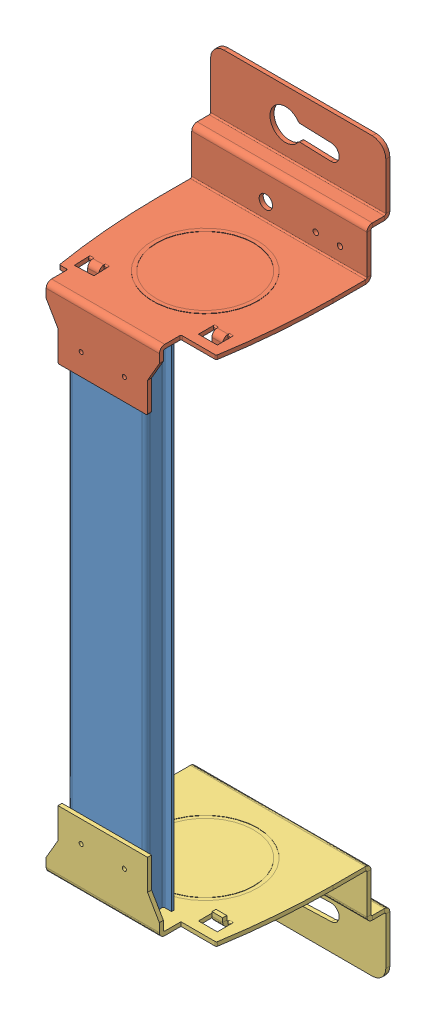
SolidWorks assembly 6LD.025.1013.SLDASM, configuration 默认 (file format 4700). Lengths in mm.
Overall size (65 270 69).
3 component instances, 3 part files, 6 mates.
Components (placement in the parent):
- 8LD.260.1026-1: 8LD.260.1026.SLDPRT [默认] at (17.5867 -92.1202 3.75) size (35 184 7.5)
- 8LD.100.1072-1: 8LD.100.1072.SLDPRT [默认] at (4.5867 110.3798 -63.75) x (0 1 0) z (0 0 -1) size (64 65 69)
- 8LD.100.1073-1: 8LD.100.1073.SLDPRT [默认] at (69.5867 -110.6202 -63.75) x (0 -1 0) z (0 0 -1) size (64 65 69)
Mates (geometry in assembly coordinates):
- 重合1: coincident anti-aligned: plane of 8LD.260.1026-1 through (17.5867 91.8798 3.75) normal (0 0 1); plane of 8LD.100.1073-1 through (69.5867 -93.6202 3.75) normal (0 0 -1)
- 重合2: coincident anti-aligned: plane of 8LD.260.1026-1 through (17.5867 91.8798 3.75) normal (0 0 1); plane of 8LD.100.1072-1 through (4.5867 93.3798 3.75) normal (0 0 -1)
- 同心1: concentric aligned: cylinder of 8LD.260.1026-1 through (40.0867 -79.1202 12.75) axis (0 0 -1) radius 1.5; cylinder of 8LD.100.1073-1 through (40.0867 -79.1202 53.75) axis (0 0 -1) radius 0.75
- 同心2: concentric anti-aligned: circle of 8LD.260.1026-1; circle of 8LD.100.1073-1
- 同心3: concentric anti-aligned: circle of 8LD.260.1026-1; circle of 8LD.100.1072-1
- 同心4: concentric aligned: circle of 8LD.260.1026-1; circle of 8LD.100.1072-1
